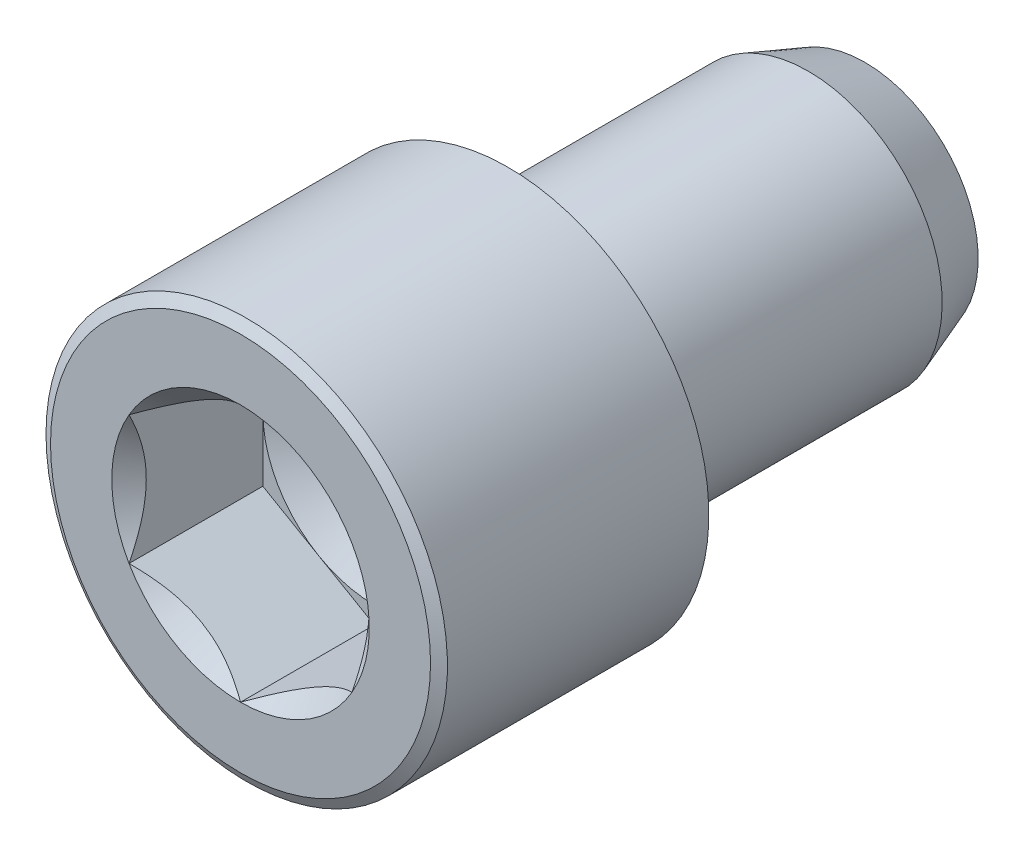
ISO-10303-21;
HEADER;
FILE_DESCRIPTION(('STEP AP214'),'2;1');
FILE_NAME('part.step','',(''),(''),'','','');
FILE_SCHEMA(('AUTOMOTIVE_DESIGN { 1 0 10303 214 1 1 1 1 }'));
ENDSEC;
DATA;
#1=APPLICATION_CONTEXT('core data for automotive mechanical design processes');
#2=APPLICATION_PROTOCOL_DEFINITION('international standard','automotive_design',2000,#1);
#3=PRODUCT_CONTEXT('',#1,'mechanical');
#4=PRODUCT('Part','Part','',(#3));
#5=PRODUCT_RELATED_PRODUCT_CATEGORY('part','',(#4));
#6=PRODUCT_DEFINITION_FORMATION('','',#4);
#7=PRODUCT_DEFINITION_CONTEXT('part definition',#1,'design');
#8=PRODUCT_DEFINITION('design','',#6,#7);
#9=PRODUCT_DEFINITION_SHAPE('','',#8);
#10=(LENGTH_UNIT() NAMED_UNIT(*) SI_UNIT(.MILLI.,.METRE.));
#11=(NAMED_UNIT(*) PLANE_ANGLE_UNIT() SI_UNIT($,.RADIAN.));
#12=(NAMED_UNIT(*) SI_UNIT($,.STERADIAN.) SOLID_ANGLE_UNIT());
#13=UNCERTAINTY_MEASURE_WITH_UNIT(LENGTH_MEASURE(1.E-05),#10,'distance_accuracy_value','');
#14=(GEOMETRIC_REPRESENTATION_CONTEXT(3) GLOBAL_UNCERTAINTY_ASSIGNED_CONTEXT((#13)) GLOBAL_UNIT_ASSIGNED_CONTEXT((#10,
#11,#12)) REPRESENTATION_CONTEXT('',''));
#15=CARTESIAN_POINT('',(0.,0.,0.));
#16=DIRECTION('',(0.,0.,1.));
#17=DIRECTION('',(1.,0.,0.));
#18=AXIS2_PLACEMENT_3D('',#15,#16,#17);
#19=CARTESIAN_POINT('',(3.96875,-6.87407664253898,4.7625));
#20=DIRECTION('',(0.,0.,1.));
#21=DIRECTION('',(1.,0.,0.));
#22=AXIS2_PLACEMENT_3D('',#19,#20,#21);
#23=PLANE('',#22);
#24=CARTESIAN_POINT('',(0.,0.,4.7625));
#25=DIRECTION('',(0.,0.,1.));
#26=DIRECTION('',(1.,0.,0.));
#27=AXIS2_PLACEMENT_3D('',#24,#25,#26);
#28=CIRCLE('',#27,3.96875);
#29=CARTESIAN_POINT('',(3.96875,0.,4.7625));
#30=VERTEX_POINT('',#29);
#31=CARTESIAN_POINT('',(1.984375,3.43703832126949,4.7625));
#32=VERTEX_POINT('',#31);
#33=EDGE_CURVE('E54',#30,#32,#28,.T.);
#34=ORIENTED_EDGE('',*,*,#33,.F.);
#35=DIRECTION('',(0.,1.,0.));
#36=VECTOR('',#35,1.);
#37=CARTESIAN_POINT('',(3.96875,-2.29135888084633,4.7625));
#38=LINE('',#37,#36);
#39=CARTESIAN_POINT('',(3.96875,2.29135888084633,4.7625));
#40=VERTEX_POINT('',#39);
#41=EDGE_CURVE('E124',#30,#40,#38,.T.);
#42=ORIENTED_EDGE('',*,*,#41,.T.);
#43=DIRECTION('',(-0.866025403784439,0.5,0.));
#44=VECTOR('',#43,1.);
#45=CARTESIAN_POINT('',(3.96875,2.29135888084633,4.7625));
#46=LINE('',#45,#44);
#47=EDGE_CURVE('E127',#40,#32,#46,.T.);
#48=ORIENTED_EDGE('',*,*,#47,.T.);
#49=EDGE_LOOP('',(#34,#42,#48));
#50=FACE_BOUND('',#49,.T.);
#51=ADVANCED_FACE('F37',(#50),#23,.T.);
#52=CARTESIAN_POINT('',(-1.984375,3.43703832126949,4.7625));
#53=VERTEX_POINT('',#52);
#54=EDGE_CURVE('E11',#32,#53,#28,.T.);
#55=ORIENTED_EDGE('',*,*,#54,.F.);
#56=CARTESIAN_POINT('',(0.,4.58271776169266,4.7625));
#57=VERTEX_POINT('',#56);
#58=EDGE_CURVE('E141',#32,#57,#46,.T.);
#59=ORIENTED_EDGE('',*,*,#58,.T.);
#60=DIRECTION('',(-0.866025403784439,-0.5,0.));
#61=VECTOR('',#60,1.);
#62=CARTESIAN_POINT('',(0.,4.58271776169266,4.7625));
#63=LINE('',#62,#61);
#64=EDGE_CURVE('E147',#57,#53,#63,.T.);
#65=ORIENTED_EDGE('',*,*,#64,.T.);
#66=EDGE_LOOP('',(#55,#59,#65));
#67=FACE_BOUND('',#66,.T.);
#68=ADVANCED_FACE('F305',(#67),#23,.T.);
#69=CARTESIAN_POINT('',(-3.96875,0.,4.7625));
#70=VERTEX_POINT('',#69);
#71=EDGE_CURVE('E52',#53,#70,#28,.T.);
#72=ORIENTED_EDGE('',*,*,#71,.F.);
#73=CARTESIAN_POINT('',(-3.96875,2.29135888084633,4.7625));
#74=VERTEX_POINT('',#73);
#75=EDGE_CURVE('E146',#53,#74,#63,.T.);
#76=ORIENTED_EDGE('',*,*,#75,.T.);
#77=DIRECTION('',(0.,-1.,0.));
#78=VECTOR('',#77,1.);
#79=CARTESIAN_POINT('',(-3.96875,2.29135888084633,4.7625));
#80=LINE('',#79,#78);
#81=EDGE_CURVE('E151',#74,#70,#80,.T.);
#82=ORIENTED_EDGE('',*,*,#81,.T.);
#83=EDGE_LOOP('',(#72,#76,#82));
#84=FACE_BOUND('',#83,.T.);
#85=ADVANCED_FACE('F309',(#84),#23,.T.);
#86=CARTESIAN_POINT('',(-1.984375,-3.43703832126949,4.7625));
#87=VERTEX_POINT('',#86);
#88=EDGE_CURVE('E322',#70,#87,#28,.T.);
#89=ORIENTED_EDGE('',*,*,#88,.F.);
#90=CARTESIAN_POINT('',(-3.96875,-2.29135888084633,4.7625));
#91=VERTEX_POINT('',#90);
#92=EDGE_CURVE('E150',#70,#91,#80,.T.);
#93=ORIENTED_EDGE('',*,*,#92,.T.);
#94=DIRECTION('',(0.866025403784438,-0.5,0.));
#95=VECTOR('',#94,1.);
#96=CARTESIAN_POINT('',(-3.96875,-2.29135888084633,4.7625));
#97=LINE('',#96,#95);
#98=EDGE_CURVE('E244',#91,#87,#97,.T.);
#99=ORIENTED_EDGE('',*,*,#98,.T.);
#100=EDGE_LOOP('',(#89,#93,#99));
#101=FACE_BOUND('',#100,.T.);
#102=ADVANCED_FACE('F314',(#101),#23,.T.);
#103=CARTESIAN_POINT('',(1.984375,-3.43703832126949,4.7625));
#104=VERTEX_POINT('',#103);
#105=EDGE_CURVE('E61',#87,#104,#28,.T.);
#106=ORIENTED_EDGE('',*,*,#105,.F.);
#107=CARTESIAN_POINT('',(0.,-4.58271776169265,4.7625));
#108=VERTEX_POINT('',#107);
#109=EDGE_CURVE('E228',#87,#108,#97,.T.);
#110=ORIENTED_EDGE('',*,*,#109,.T.);
#111=DIRECTION('',(0.866025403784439,0.5,0.));
#112=VECTOR('',#111,1.);
#113=CARTESIAN_POINT('',(0.,-4.58271776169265,4.7625));
#114=LINE('',#113,#112);
#115=EDGE_CURVE('E136',#108,#104,#114,.T.);
#116=ORIENTED_EDGE('',*,*,#115,.T.);
#117=EDGE_LOOP('',(#106,#110,#116));
#118=FACE_BOUND('',#117,.T.);
#119=ADVANCED_FACE('F303',(#118),#23,.T.);
#120=CARTESIAN_POINT('',(0.,0.,0.));
#121=DIRECTION('',(0.,0.,-1.));
#122=DIRECTION('',(0.,1.,0.));
#123=AXIS2_PLACEMENT_3D('',#120,#121,#122);
#124=CYLINDRICAL_SURFACE('',#123,4.7625);
#125=CARTESIAN_POINT('',(0.,0.,-10.6850324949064));
#126=DIRECTION('',(0.,0.,-1.));
#127=DIRECTION('',(0.,1.,0.));
#128=AXIS2_PLACEMENT_3D('',#125,#126,#127);
#129=CIRCLE('',#128,4.7625);
#130=CARTESIAN_POINT('',(0.,4.7625,-10.6850324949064));
#131=VERTEX_POINT('',#130);
#132=EDGE_CURVE('E178',#131,#131,#129,.T.);
#133=ORIENTED_EDGE('',*,*,#132,.F.);
#134=EDGE_LOOP('',(#133));
#135=FACE_BOUND('',#134,.T.);
#136=CARTESIAN_POINT('',(0.,0.,0.));
#137=DIRECTION('',(0.,0.,1.));
#138=DIRECTION('',(1.,0.,0.));
#139=AXIS2_PLACEMENT_3D('',#136,#137,#138);
#140=CIRCLE('',#139,4.7625);
#141=CARTESIAN_POINT('',(4.7625,0.,0.));
#142=VERTEX_POINT('',#141);
#143=EDGE_CURVE('E172',#142,#142,#140,.F.);
#144=ORIENTED_EDGE('',*,*,#143,.T.);
#145=EDGE_LOOP('',(#144));
#146=FACE_BOUND('',#145,.T.);
#147=ADVANCED_FACE('F326',(#135,#146),#124,.T.);
#148=CARTESIAN_POINT('',(0.,0.,-10.6850324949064));
#149=DIRECTION('',(0.,0.,1.));
#150=DIRECTION('',(0.,-1.,0.));
#151=AXIS2_PLACEMENT_3D('',#148,#149,#150);
#152=CONICAL_SURFACE('',#151,4.7625,0.349065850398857);
#153=CARTESIAN_POINT('',(0.,0.,-12.7));
#154=DIRECTION('',(0.,0.,-1.));
#155=DIRECTION('',(0.,1.,0.));
#156=AXIS2_PLACEMENT_3D('',#153,#154,#155);
#157=CIRCLE('',#156,4.02911180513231);
#158=CARTESIAN_POINT('',(0.,4.02911180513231,-12.7));
#159=VERTEX_POINT('',#158);
#160=EDGE_CURVE('E175',#159,#159,#157,.T.);
#161=ORIENTED_EDGE('',*,*,#160,.F.);
#162=EDGE_LOOP('',(#161));
#163=FACE_BOUND('',#162,.T.);
#164=ORIENTED_EDGE('',*,*,#132,.T.);
#165=EDGE_LOOP('',(#164));
#166=FACE_BOUND('',#165,.T.);
#167=ADVANCED_FACE('F331',(#163,#166),#152,.T.);
#168=CARTESIAN_POINT('',(0.,0.,-12.7));
#169=DIRECTION('',(0.,0.,-1.));
#170=DIRECTION('',(0.,1.,0.));
#171=AXIS2_PLACEMENT_3D('',#168,#169,#170);
#172=PLANE('',#171);
#173=ORIENTED_EDGE('',*,*,#160,.T.);
#174=EDGE_LOOP('',(#173));
#175=FACE_BOUND('',#174,.T.);
#176=ADVANCED_FACE('F422',(#175),#172,.T.);
#177=CARTESIAN_POINT('',(0.,0.,9.525));
#178=DIRECTION('',(0.,0.,-1.));
#179=DIRECTION('',(-1.,0.,0.));
#180=AXIS2_PLACEMENT_3D('',#177,#178,#179);
#181=CYLINDRICAL_SURFACE('',#180,7.14375);
#182=CARTESIAN_POINT('',(0.,0.,9.30502954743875));
#183=DIRECTION('',(0.,0.,1.));
#184=DIRECTION('',(1.,0.,0.));
#185=AXIS2_PLACEMENT_3D('',#182,#183,#184);
#186=CIRCLE('',#185,7.14375);
#187=CARTESIAN_POINT('',(-7.14375,0.,9.30502954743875));
#188=VERTEX_POINT('',#187);
#189=EDGE_CURVE('E183',#188,#188,#186,.F.);
#190=CARTESIAN_POINT('',(0.,0.,0.));
#191=DIRECTION('',(0.,0.,1.));
#192=DIRECTION('',(1.,0.,0.));
#193=AXIS2_PLACEMENT_3D('',#190,#191,#192);
#194=CIRCLE('',#193,7.14375);
#195=CARTESIAN_POINT('',(-7.14375,0.,0.));
#196=VERTEX_POINT('',#195);
#197=EDGE_CURVE('E158',#196,#196,#194,.T.);
#198=CARTESIAN_POINT('',(-7.14375,0.,9.30502954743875));
#199=CARTESIAN_POINT('',(-7.14375,0.,9.2081021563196));
#200=CARTESIAN_POINT('',(-7.14375,0.,9.11117476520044));
#201=CARTESIAN_POINT('',(-7.14375,0.,8.91731998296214));
#202=CARTESIAN_POINT('',(-7.14375,0.,8.82039259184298));
#203=CARTESIAN_POINT('',(-7.14375,0.,8.62653780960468));
#204=CARTESIAN_POINT('',(-7.14375,0.,8.52961041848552));
#205=CARTESIAN_POINT('',(-7.14375,0.,8.33575563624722));
#206=CARTESIAN_POINT('',(-7.14375,0.,8.23882824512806));
#207=CARTESIAN_POINT('',(-7.14375,0.,8.04497346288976));
#208=CARTESIAN_POINT('',(-7.14375,0.,7.9480460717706));
#209=CARTESIAN_POINT('',(-7.14375,0.,7.75419128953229));
#210=CARTESIAN_POINT('',(-7.14375,0.,7.65726389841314));
#211=CARTESIAN_POINT('',(-7.14375,0.,7.46340911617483));
#212=CARTESIAN_POINT('',(-7.14375,0.,7.36648172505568));
#213=CARTESIAN_POINT('',(-7.14375,0.,7.17262694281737));
#214=CARTESIAN_POINT('',(-7.14375,0.,7.07569955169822));
#215=CARTESIAN_POINT('',(-7.14375,0.,6.88184476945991));
#216=CARTESIAN_POINT('',(-7.14375,0.,6.78491737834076));
#217=CARTESIAN_POINT('',(-7.14375,0.,6.59106259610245));
#218=CARTESIAN_POINT('',(-7.14375,0.,6.4941352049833));
#219=CARTESIAN_POINT('',(-7.14375,0.,6.30028042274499));
#220=CARTESIAN_POINT('',(-7.14375,0.,6.20335303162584));
#221=CARTESIAN_POINT('',(-7.14375,0.,6.00949824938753));
#222=CARTESIAN_POINT('',(-7.14375,0.,5.91257085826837));
#223=CARTESIAN_POINT('',(-7.14375,0.,5.71871607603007));
#224=CARTESIAN_POINT('',(-7.14375,0.,5.62178868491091));
#225=CARTESIAN_POINT('',(-7.14375,0.,5.42793390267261));
#226=CARTESIAN_POINT('',(-7.14375,0.,5.33100651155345));
#227=CARTESIAN_POINT('',(-7.14375,0.,5.13715172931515));
#228=CARTESIAN_POINT('',(-7.14375,0.,5.04022433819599));
#229=CARTESIAN_POINT('',(-7.14375,0.,4.84636955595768));
#230=CARTESIAN_POINT('',(-7.14375,0.,4.74944216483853));
#231=CARTESIAN_POINT('',(-7.14375,0.,4.55558738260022));
#232=CARTESIAN_POINT('',(-7.14375,0.,4.45865999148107));
#233=CARTESIAN_POINT('',(-7.14375,0.,4.26480520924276));
#234=CARTESIAN_POINT('',(-7.14375,0.,4.16787781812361));
#235=CARTESIAN_POINT('',(-7.14375,0.,3.9740230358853));
#236=CARTESIAN_POINT('',(-7.14375,0.,3.87709564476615));
#237=CARTESIAN_POINT('',(-7.14375,0.,3.68324086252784));
#238=CARTESIAN_POINT('',(-7.14375,0.,3.58631347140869));
#239=CARTESIAN_POINT('',(-7.14375,0.,3.39245868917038));
#240=CARTESIAN_POINT('',(-7.14375,0.,3.29553129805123));
#241=CARTESIAN_POINT('',(-7.14375,0.,3.10167651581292));
#242=CARTESIAN_POINT('',(-7.14375,0.,3.00474912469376));
#243=CARTESIAN_POINT('',(-7.14375,0.,2.81089434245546));
#244=CARTESIAN_POINT('',(-7.14375,0.,2.7139669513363));
#245=CARTESIAN_POINT('',(-7.14375,0.,2.520112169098));
#246=CARTESIAN_POINT('',(-7.14375,0.,2.42318477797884));
#247=CARTESIAN_POINT('',(-7.14375,0.,2.22932999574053));
#248=CARTESIAN_POINT('',(-7.14375,0.,2.13240260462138));
#249=CARTESIAN_POINT('',(-7.14375,0.,1.93854782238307));
#250=CARTESIAN_POINT('',(-7.14375,0.,1.84162043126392));
#251=CARTESIAN_POINT('',(-7.14375,0.,1.64776564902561));
#252=CARTESIAN_POINT('',(-7.14375,0.,1.55083825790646));
#253=CARTESIAN_POINT('',(-7.14375,0.,1.35698347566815));
#254=CARTESIAN_POINT('',(-7.14375,0.,1.260056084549));
#255=CARTESIAN_POINT('',(-7.14375,0.,1.06620130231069));
#256=CARTESIAN_POINT('',(-7.14375,0.,0.969273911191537));
#257=CARTESIAN_POINT('',(-7.14375,0.,0.77541912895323));
#258=CARTESIAN_POINT('',(-7.14375,0.,0.678491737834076));
#259=CARTESIAN_POINT('',(-7.14375,0.,0.484636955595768));
#260=CARTESIAN_POINT('',(-7.14375,0.,0.387709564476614));
#261=CARTESIAN_POINT('',(-7.14375,0.,0.193854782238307));
#262=CARTESIAN_POINT('',(-7.14375,0.,0.0969273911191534));
#263=CARTESIAN_POINT('',(-7.14375,0.,0.));
#264=B_SPLINE_CURVE_WITH_KNOTS('',3,(#198,#199,#200,#201,#202,#203,#204,#205,#206,#207,#208,
#209,#210,#211,#212,#213,#214,#215,#216,#217,#218,#219,#220,#221,#222,#223,#224,#225,#226,#227,
#228,#229,#230,#231,#232,#233,#234,#235,#236,#237,#238,#239,#240,#241,#242,#243,#244,#245,#246,
#247,#248,#249,#250,#251,#252,#253,#254,#255,#256,#257,#258,#259,#260,#261,#262,#263),
.UNSPECIFIED.,.F.,.F.,(4,2,2,2,2,2,2,2,2,2,2,2,2,2,2,2,2,2,2,2,2,2,2,2,2,2,2,2,2,2,2,2,4),(0.,
0.29078217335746,0.58156434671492,0.872346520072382,1.16312869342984,1.4539108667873,
1.74469304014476,2.03547521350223,2.32625738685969,2.61703956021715,2.90782173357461,
3.19860390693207,3.48938608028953,3.78016825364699,4.07095042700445,4.36173260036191,
4.65251477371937,4.94329694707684,5.2340791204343,5.52486129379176,5.81564346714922,
6.10642564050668,6.39720781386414,6.6879899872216,6.97877216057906,7.26955433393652,
7.56033650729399,7.85111868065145,8.14190085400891,8.43268302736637,8.72346520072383,
9.01424737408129,9.30502954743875),.UNSPECIFIED.);
#265=EDGE_CURVE('BSEAM404',#188,#196,#264,.T.);
#266=ORIENTED_EDGE('',*,*,#189,.T.);
#267=ORIENTED_EDGE('',*,*,#197,.T.);
#268=ORIENTED_EDGE('',*,*,#265,.T.);
#269=ORIENTED_EDGE('',*,*,#265,.F.);
#270=EDGE_LOOP('',(#266,#268,#267,#269));
#271=FACE_BOUND('',#270,.T.);
#272=ADVANCED_FACE('F404',(#271),#181,.T.);
#273=CARTESIAN_POINT('',(0.,0.,9.525));
#274=DIRECTION('',(0.,0.,1.));
#275=DIRECTION('',(1.,0.,0.));
#276=AXIS2_PLACEMENT_3D('',#273,#274,#275);
#277=PLANE('',#276);
#278=CARTESIAN_POINT('',(0.,0.,9.525));
#279=DIRECTION('',(0.,0.,1.));
#280=DIRECTION('',(1.,0.,0.));
#281=AXIS2_PLACEMENT_3D('',#278,#279,#280);
#282=CIRCLE('',#281,4.58271776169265);
#283=CARTESIAN_POINT('',(3.96875,2.29135888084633,9.525));
#284=VERTEX_POINT('',#283);
#285=CARTESIAN_POINT('',(0.,4.58271776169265,9.525));
#286=VERTEX_POINT('',#285);
#287=EDGE_CURVE('E211',#284,#286,#282,.T.);
#288=ORIENTED_EDGE('',*,*,#287,.F.);
#289=CARTESIAN_POINT('',(3.96875,-2.29135888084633,9.525));
#290=VERTEX_POINT('',#289);
#291=EDGE_CURVE('E204',#290,#284,#282,.T.);
#292=ORIENTED_EDGE('',*,*,#291,.F.);
#293=CARTESIAN_POINT('',(0.,-4.58271776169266,9.525));
#294=VERTEX_POINT('',#293);
#295=EDGE_CURVE('E197',#294,#290,#282,.T.);
#296=ORIENTED_EDGE('',*,*,#295,.F.);
#297=CARTESIAN_POINT('',(-3.96875,-2.29135888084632,9.525));
#298=VERTEX_POINT('',#297);
#299=EDGE_CURVE('E203',#298,#294,#282,.T.);
#300=ORIENTED_EDGE('',*,*,#299,.F.);
#301=CARTESIAN_POINT('',(-3.96875,2.29135888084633,9.525));
#302=VERTEX_POINT('',#301);
#303=EDGE_CURVE('E68',#302,#298,#282,.T.);
#304=ORIENTED_EDGE('',*,*,#303,.F.);
#305=EDGE_CURVE('E219',#286,#302,#282,.T.);
#306=ORIENTED_EDGE('',*,*,#305,.F.);
#307=EDGE_LOOP('',(#288,#292,#296,#300,#304,#306));
#308=FACE_BOUND('',#307,.T.);
#309=CARTESIAN_POINT('',(0.,0.,9.525));
#310=DIRECTION('',(0.,0.,1.));
#311=DIRECTION('',(1.,0.,0.));
#312=AXIS2_PLACEMENT_3D('',#309,#310,#311);
#313=CIRCLE('',#312,6.76275);
#314=CARTESIAN_POINT('',(6.76275,0.,9.525));
#315=VERTEX_POINT('',#314);
#316=EDGE_CURVE('E181',#315,#315,#313,.T.);
#317=ORIENTED_EDGE('',*,*,#316,.T.);
#318=EDGE_LOOP('',(#317));
#319=FACE_BOUND('',#318,.T.);
#320=ADVANCED_FACE('F214',(#308,#319),#277,.T.);
#321=CARTESIAN_POINT('',(0.,0.,0.));
#322=DIRECTION('',(0.,0.,1.));
#323=DIRECTION('',(1.,0.,0.));
#324=AXIS2_PLACEMENT_3D('',#321,#322,#323);
#325=PLANE('',#324);
#326=ORIENTED_EDGE('',*,*,#143,.F.);
#327=EDGE_LOOP('',(#326));
#328=FACE_BOUND('',#327,.T.);
#329=ORIENTED_EDGE('',*,*,#197,.F.);
#330=EDGE_LOOP('',(#329));
#331=FACE_BOUND('',#330,.T.);
#332=ADVANCED_FACE('F403',(#328,#331),#325,.F.);
#333=CARTESIAN_POINT('',(0.,0.,9.525));
#334=DIRECTION('',(0.,0.,-1.));
#335=DIRECTION('',(-1.,0.,0.));
#336=AXIS2_PLACEMENT_3D('',#333,#334,#335);
#337=CONICAL_SURFACE('',#336,6.76275,1.0471975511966);
#338=ORIENTED_EDGE('',*,*,#189,.F.);
#339=EDGE_LOOP('',(#338));
#340=FACE_BOUND('',#339,.T.);
#341=ORIENTED_EDGE('',*,*,#316,.F.);
#342=EDGE_LOOP('',(#341));
#343=FACE_BOUND('',#342,.T.);
#344=ADVANCED_FACE('F39',(#340,#343),#337,.T.);
#345=CARTESIAN_POINT('',(0.,0.,9.525));
#346=DIRECTION('',(0.,0.,1.));
#347=DIRECTION('',(1.,0.,0.));
#348=AXIS2_PLACEMENT_3D('',#345,#346,#347);
#349=CONICAL_SURFACE('',#348,4.58271776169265,0.78539816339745);
#350=ORIENTED_EDGE('',*,*,#295,.T.);
#351=CARTESIAN_POINT('',(-0.000200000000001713,-4.58283323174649,9.52511547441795));
#352=CARTESIAN_POINT('',(0.0680436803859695,-4.54343272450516,9.48571901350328));
#353=CARTESIAN_POINT('',(0.136809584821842,-4.50373071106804,9.44753121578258));
#354=CARTESIAN_POINT('',(0.275493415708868,-4.42366156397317,9.3739413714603));
#355=CARTESIAN_POINT('',(0.345411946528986,-4.38329408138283,9.33854084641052));
#356=CARTESIAN_POINT('',(0.557707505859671,-4.2607251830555,9.23677090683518));
#357=CARTESIAN_POINT('',(0.701888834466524,-4.17748205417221,9.17526734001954));
#358=CARTESIAN_POINT('',(0.992585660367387,-4.00964816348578,9.06993929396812));
#359=CARTESIAN_POINT('',(1.13902772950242,-3.92509979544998,9.02584957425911));
#360=CARTESIAN_POINT('',(1.43514553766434,-3.75413609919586,8.95791431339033));
#361=CARTESIAN_POINT('',(1.58481220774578,-3.66772600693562,8.9340180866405));
#362=CARTESIAN_POINT('',(1.84275672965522,-3.51880166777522,8.9124580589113));
#363=CARTESIAN_POINT('',(1.95070224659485,-3.45647929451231,8.90926720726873));
#364=CARTESIAN_POINT('',(2.16641807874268,-3.3319357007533,8.91464597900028));
#365=CARTESIAN_POINT('',(2.27418831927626,-3.2697145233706,8.92321972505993));
#366=CARTESIAN_POINT('',(2.48870765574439,-3.14586172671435,8.95163865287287));
#367=CARTESIAN_POINT('',(2.59545547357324,-3.08423084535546,8.9714964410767));
#368=CARTESIAN_POINT('',(2.80711777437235,-2.96202755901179,9.02139945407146));
#369=CARTESIAN_POINT('',(2.91203239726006,-2.90145507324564,9.05144389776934));
#370=CARTESIAN_POINT('',(3.0982812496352,-2.7939242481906,9.11325729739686));
#371=CARTESIAN_POINT('',(3.18002783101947,-2.74672783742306,9.1434010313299));
#372=CARTESIAN_POINT('',(3.34205349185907,-2.65318227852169,9.2085463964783));
#373=CARTESIAN_POINT('',(3.42233252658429,-2.6068331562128,9.24354817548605));
#374=CARTESIAN_POINT('',(3.58117016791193,-2.51512820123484,9.31762497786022));
#375=CARTESIAN_POINT('',(3.65973329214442,-2.46976976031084,9.35668719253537));
#376=CARTESIAN_POINT('',(3.81540464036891,-2.37989286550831,9.43837192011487));
#377=CARTESIAN_POINT('',(3.89251372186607,-2.33537391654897,9.48099224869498));
#378=CARTESIAN_POINT('',(3.96895,-2.29124341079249,9.52511547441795));
#379=B_SPLINE_CURVE_WITH_KNOTS('',3,(#351,#352,#353,#354,#355,#356,#357,#358,#359,#360,#361,
#362,#363,#364,#365,#366,#367,#368,#369,#370,#371,#372,#373,#374,#375,#376,#377,#378),
.UNSPECIFIED.,.F.,.F.,(4,2,2,2,2,2,2,2,2,2,2,2,2,4),(0.,0.264281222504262,0.528705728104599,
1.06040984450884,1.58367029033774,2.10561342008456,2.47914251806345,2.85280254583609,
3.22688084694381,3.60093047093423,3.89805841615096,4.19519540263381,4.49142198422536,
4.78746803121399),.UNSPECIFIED.);
#380=EDGE_CURVE('E41',#294,#290,#379,.T.);
#381=ORIENTED_EDGE('',*,*,#380,.F.);
#382=EDGE_LOOP('',(#350,#381));
#383=FACE_BOUND('',#382,.T.);
#384=ADVANCED_FACE('F199',(#383),#349,.F.);
#385=ORIENTED_EDGE('',*,*,#291,.T.);
#386=CARTESIAN_POINT('',(3.96875,-4.56990484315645,10.9949681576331));
#387=CARTESIAN_POINT('',(3.96875,-4.45863268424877,10.9109744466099));
#388=CARTESIAN_POINT('',(3.96875,-4.34673751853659,10.8277926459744));
#389=CARTESIAN_POINT('',(3.96875,-4.12145541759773,10.6634163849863));
#390=CARTESIAN_POINT('',(3.96875,-4.00806811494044,10.5822224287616));
#391=CARTESIAN_POINT('',(3.96875,-3.77872655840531,10.4216080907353));
#392=CARTESIAN_POINT('',(3.96875,-3.66275922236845,10.3422063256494));
#393=CARTESIAN_POINT('',(3.96875,-3.42885613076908,10.1863665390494));
#394=CARTESIAN_POINT('',(3.96875,-3.31092051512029,10.1099283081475));
#395=CARTESIAN_POINT('',(3.96875,-3.06596138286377,9.95640911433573));
#396=CARTESIAN_POINT('',(3.96875,-2.9388037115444,9.87954112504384));
#397=CARTESIAN_POINT('',(3.96875,-2.68152025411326,9.73086253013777));
#398=CARTESIAN_POINT('',(3.96875,-2.55139400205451,9.65905272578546));
#399=CARTESIAN_POINT('',(3.96875,-2.288185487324,9.52203990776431));
#400=CARTESIAN_POINT('',(3.96875,-2.15511341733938,9.45681746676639));
#401=CARTESIAN_POINT('',(3.96875,-1.88534004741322,9.33443946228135));
#402=CARTESIAN_POINT('',(3.96875,-1.74864042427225,9.27728024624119));
#403=CARTESIAN_POINT('',(3.96875,-1.48255876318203,9.17725771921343));
#404=CARTESIAN_POINT('',(3.96875,-1.35347311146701,9.13361413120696));
#405=CARTESIAN_POINT('',(3.96875,-1.09219394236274,9.05668291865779));
#406=CARTESIAN_POINT('',(3.96875,-0.960000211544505,9.02339600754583));
#407=CARTESIAN_POINT('',(3.96875,-0.695492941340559,8.96947024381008));
#408=CARTESIAN_POINT('',(3.96875,-0.563224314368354,8.94861468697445));
#409=CARTESIAN_POINT('',(3.96875,-0.297273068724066,8.91995642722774));
#410=CARTESIAN_POINT('',(3.96875,-0.163590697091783,8.91215148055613));
#411=CARTESIAN_POINT('',(3.96875,0.0990312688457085,8.910174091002));
#412=CARTESIAN_POINT('',(3.96875,0.227967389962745,8.91551843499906));
#413=CARTESIAN_POINT('',(3.96875,0.484735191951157,8.93847834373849));
#414=CARTESIAN_POINT('',(3.96875,0.61256676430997,8.95609510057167));
#415=CARTESIAN_POINT('',(3.96875,0.868361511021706,9.00293836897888));
#416=CARTESIAN_POINT('',(3.96875,0.996287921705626,9.03236244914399));
#417=CARTESIAN_POINT('',(3.96875,1.24935336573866,9.10125112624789));
#418=CARTESIAN_POINT('',(3.96875,1.37449263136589,9.14071488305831));
#419=CARTESIAN_POINT('',(3.96875,1.63331643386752,9.23211814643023));
#420=CARTESIAN_POINT('',(3.96875,1.76670819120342,9.28487836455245));
#421=CARTESIAN_POINT('',(3.96875,2.03002683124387,9.39849870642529));
#422=CARTESIAN_POINT('',(3.96875,2.15995206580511,9.4593626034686));
#423=CARTESIAN_POINT('',(3.96875,2.4169726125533,9.58774222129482));
#424=CARTESIAN_POINT('',(3.96875,2.54405740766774,9.65527882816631));
#425=CARTESIAN_POINT('',(3.96875,2.7953024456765,9.79551112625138));
#426=CARTESIAN_POINT('',(3.96875,2.91946314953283,9.86820599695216));
#427=CARTESIAN_POINT('',(3.96875,3.15913302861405,10.0140188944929));
#428=CARTESIAN_POINT('',(3.96875,3.27476522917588,10.0869357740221));
#429=CARTESIAN_POINT('',(3.96875,3.50404450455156,10.2358358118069));
#430=CARTESIAN_POINT('',(3.96875,3.61769142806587,10.3118192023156));
#431=CARTESIAN_POINT('',(3.96875,3.84233840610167,10.4656765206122));
#432=CARTESIAN_POINT('',(3.96875,3.95335246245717,10.543530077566));
#433=CARTESIAN_POINT('',(3.96875,4.17386344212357,10.7012960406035));
#434=CARTESIAN_POINT('',(3.96875,4.28336077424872,10.7812078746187));
#435=CARTESIAN_POINT('',(3.96875,4.39222298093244,10.8619612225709));
#436=B_SPLINE_CURVE_WITH_KNOTS('',3,(#386,#387,#388,#389,#390,#391,#392,#393,#394,#395,#396,
#397,#398,#399,#400,#401,#402,#403,#404,#405,#406,#407,#408,#409,#410,#411,#412,#413,#414,#415,
#416,#417,#418,#419,#420,#421,#422,#423,#424,#425,#426,#427,#428,#429,#430,#431,#432,#433,#434,
#435),.UNSPECIFIED.,.F.,.F.,(4,2,2,2,2,2,2,2,2,2,2,2,2,2,2,2,2,2,2,2,2,2,2,2,4),(0.,
0.418252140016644,0.836609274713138,1.25820795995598,1.67977680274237,2.12544086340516,
2.57117536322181,3.01555437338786,3.45973143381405,3.86816421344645,4.27662512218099,
4.6777400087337,5.07878592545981,5.46531568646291,5.85188299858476,6.24520796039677,
6.63850001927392,7.06850560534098,7.49871211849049,7.93031065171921,8.3618406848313,
8.77189246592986,9.18197536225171,9.58872710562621,9.99536699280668),.UNSPECIFIED.);
#437=EDGE_CURVE('E207',#290,#284,#436,.T.);
#438=ORIENTED_EDGE('',*,*,#437,.F.);
#439=EDGE_LOOP('',(#385,#438));
#440=FACE_BOUND('',#439,.T.);
#441=ADVANCED_FACE('F208',(#440),#349,.F.);
#442=ORIENTED_EDGE('',*,*,#287,.T.);
#443=CARTESIAN_POINT('',(3.96895,2.29124341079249,9.52511547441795));
#444=CARTESIAN_POINT('',(3.90070631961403,2.33064391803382,9.48571901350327));
#445=CARTESIAN_POINT('',(3.83194041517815,2.37034593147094,9.44753121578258));
#446=CARTESIAN_POINT('',(3.69325658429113,2.45041507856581,9.3739413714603));
#447=CARTESIAN_POINT('',(3.62333805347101,2.49078256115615,9.33854084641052));
#448=CARTESIAN_POINT('',(3.41104249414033,2.61335145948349,9.23677090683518));
#449=CARTESIAN_POINT('',(3.26686116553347,2.69659458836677,9.17526734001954));
#450=CARTESIAN_POINT('',(2.97616433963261,2.8644284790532,9.06993929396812));
#451=CARTESIAN_POINT('',(2.82972227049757,2.948976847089,9.02584957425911));
#452=CARTESIAN_POINT('',(2.53360446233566,3.11994054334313,8.95791431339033));
#453=CARTESIAN_POINT('',(2.38393779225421,3.20635063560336,8.9340180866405));
#454=CARTESIAN_POINT('',(2.12599327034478,3.35527497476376,8.9124580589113));
#455=CARTESIAN_POINT('',(2.01804775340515,3.41759734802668,8.90926720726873));
#456=CARTESIAN_POINT('',(1.80233192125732,3.54214094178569,8.91464597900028));
#457=CARTESIAN_POINT('',(1.69456168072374,3.60436211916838,8.92321972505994));
#458=CARTESIAN_POINT('',(1.4800423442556,3.72821491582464,8.95163865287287));
#459=CARTESIAN_POINT('',(1.37329452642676,3.78984579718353,8.9714964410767));
#460=CARTESIAN_POINT('',(1.16163222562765,3.91204908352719,9.02139945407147));
#461=CARTESIAN_POINT('',(1.05671760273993,3.97262156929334,9.05144389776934));
#462=CARTESIAN_POINT('',(0.870468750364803,4.08015239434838,9.11325729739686));
#463=CARTESIAN_POINT('',(0.788722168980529,4.12734880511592,9.1434010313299));
#464=CARTESIAN_POINT('',(0.626696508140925,4.22089436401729,9.2085463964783));
#465=CARTESIAN_POINT('',(0.546417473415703,4.26724348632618,9.24354817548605));
#466=CARTESIAN_POINT('',(0.387579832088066,4.35894844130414,9.31762497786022));
#467=CARTESIAN_POINT('',(0.309016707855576,4.40430688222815,9.35668719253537));
#468=CARTESIAN_POINT('',(0.153345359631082,4.49418377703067,9.43837192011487));
#469=CARTESIAN_POINT('',(0.0762362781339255,4.53870272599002,9.48099224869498));
#470=CARTESIAN_POINT('',(-0.000200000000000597,4.58283323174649,9.52511547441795));
#471=B_SPLINE_CURVE_WITH_KNOTS('',3,(#443,#444,#445,#446,#447,#448,#449,#450,#451,#452,#453,
#454,#455,#456,#457,#458,#459,#460,#461,#462,#463,#464,#465,#466,#467,#468,#469,#470),
.UNSPECIFIED.,.F.,.F.,(4,2,2,2,2,2,2,2,2,2,2,2,2,4),(0.,0.264281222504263,0.528705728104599,
1.06040984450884,1.58367029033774,2.10561342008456,2.47914251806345,2.85280254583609,
3.22688084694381,3.60093047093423,3.89805841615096,4.19519540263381,4.49142198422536,
4.78746803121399),.UNSPECIFIED.);
#472=EDGE_CURVE('E210',#284,#286,#471,.T.);
#473=ORIENTED_EDGE('',*,*,#472,.F.);
#474=EDGE_LOOP('',(#442,#473));
#475=FACE_BOUND('',#474,.T.);
#476=ADVANCED_FACE('F372',(#475),#349,.F.);
#477=ORIENTED_EDGE('',*,*,#305,.T.);
#478=CARTESIAN_POINT('',(0.000200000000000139,4.58283323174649,9.52511547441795));
#479=CARTESIAN_POINT('',(-0.0680436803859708,4.54343272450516,9.48571901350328));
#480=CARTESIAN_POINT('',(-0.136809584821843,4.50373071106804,9.44753121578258));
#481=CARTESIAN_POINT('',(-0.27549341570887,4.42366156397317,9.3739413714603));
#482=CARTESIAN_POINT('',(-0.345411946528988,4.38329408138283,9.33854084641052));
#483=CARTESIAN_POINT('',(-0.557707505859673,4.2607251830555,9.23677090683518));
#484=CARTESIAN_POINT('',(-0.701888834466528,4.17748205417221,9.17526734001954));
#485=CARTESIAN_POINT('',(-0.992585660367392,4.00964816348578,9.06993929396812));
#486=CARTESIAN_POINT('',(-1.13902772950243,3.92509979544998,9.02584957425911));
#487=CARTESIAN_POINT('',(-1.43514553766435,3.75413609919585,8.95791431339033));
#488=CARTESIAN_POINT('',(-1.58481220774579,3.66772600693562,8.9340180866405));
#489=CARTESIAN_POINT('',(-1.84275672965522,3.51880166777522,8.9124580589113));
#490=CARTESIAN_POINT('',(-1.95070224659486,3.45647929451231,8.90926720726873));
#491=CARTESIAN_POINT('',(-2.16641807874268,3.3319357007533,8.91464597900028));
#492=CARTESIAN_POINT('',(-2.27418831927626,3.2697145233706,8.92321972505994));
#493=CARTESIAN_POINT('',(-2.4887076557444,3.14586172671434,8.95163865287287));
#494=CARTESIAN_POINT('',(-2.59545547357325,3.08423084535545,8.9714964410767));
#495=CARTESIAN_POINT('',(-2.80711777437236,2.96202755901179,9.02139945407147));
#496=CARTESIAN_POINT('',(-2.91203239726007,2.90145507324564,9.05144389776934));
#497=CARTESIAN_POINT('',(-3.0982812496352,2.7939242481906,9.11325729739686));
#498=CARTESIAN_POINT('',(-3.18002783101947,2.74672783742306,9.1434010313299));
#499=CARTESIAN_POINT('',(-3.34205349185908,2.65318227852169,9.2085463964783));
#500=CARTESIAN_POINT('',(-3.4223325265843,2.6068331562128,9.24354817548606));
#501=CARTESIAN_POINT('',(-3.58117016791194,2.51512820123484,9.31762497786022));
#502=CARTESIAN_POINT('',(-3.65973329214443,2.46976976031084,9.35668719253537));
#503=CARTESIAN_POINT('',(-3.81540464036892,2.37989286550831,9.43837192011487));
#504=CARTESIAN_POINT('',(-3.89251372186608,2.33537391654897,9.48099224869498));
#505=CARTESIAN_POINT('',(-3.96895,2.29124341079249,9.52511547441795));
#506=B_SPLINE_CURVE_WITH_KNOTS('',3,(#478,#479,#480,#481,#482,#483,#484,#485,#486,#487,#488,
#489,#490,#491,#492,#493,#494,#495,#496,#497,#498,#499,#500,#501,#502,#503,#504,#505),
.UNSPECIFIED.,.F.,.F.,(4,2,2,2,2,2,2,2,2,2,2,2,2,4),(0.,0.264281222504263,0.5287057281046,
1.06040984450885,1.58367029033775,2.10561342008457,2.47914251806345,2.85280254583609,
3.22688084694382,3.60093047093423,3.89805841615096,4.19519540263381,4.49142198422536,
4.78746803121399),.UNSPECIFIED.);
#507=EDGE_CURVE('E239',#286,#302,#506,.T.);
#508=ORIENTED_EDGE('',*,*,#507,.F.);
#509=EDGE_LOOP('',(#477,#508));
#510=FACE_BOUND('',#509,.T.);
#511=ADVANCED_FACE('F364',(#510),#349,.F.);
#512=ORIENTED_EDGE('',*,*,#303,.T.);
#513=CARTESIAN_POINT('',(-3.96875,-4.56990484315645,10.9949681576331));
#514=CARTESIAN_POINT('',(-3.96875,-4.45863268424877,10.9109744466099));
#515=CARTESIAN_POINT('',(-3.96875,-4.34673751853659,10.8277926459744));
#516=CARTESIAN_POINT('',(-3.96875,-4.12145541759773,10.6634163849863));
#517=CARTESIAN_POINT('',(-3.96875,-4.00806811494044,10.5822224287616));
#518=CARTESIAN_POINT('',(-3.96875,-3.77872655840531,10.4216080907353));
#519=CARTESIAN_POINT('',(-3.96875,-3.66275922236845,10.3422063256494));
#520=CARTESIAN_POINT('',(-3.96875,-3.42885613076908,10.1863665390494));
#521=CARTESIAN_POINT('',(-3.96875,-3.31092051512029,10.1099283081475));
#522=CARTESIAN_POINT('',(-3.96875,-3.06596138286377,9.95640911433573));
#523=CARTESIAN_POINT('',(-3.96875,-2.9388037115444,9.87954112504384));
#524=CARTESIAN_POINT('',(-3.96875,-2.68152025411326,9.73086253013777));
#525=CARTESIAN_POINT('',(-3.96875,-2.55139400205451,9.65905272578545));
#526=CARTESIAN_POINT('',(-3.96875,-2.288185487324,9.52203990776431));
#527=CARTESIAN_POINT('',(-3.96875,-2.15511341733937,9.45681746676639));
#528=CARTESIAN_POINT('',(-3.96875,-1.88534004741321,9.33443946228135));
#529=CARTESIAN_POINT('',(-3.96875,-1.74864042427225,9.27728024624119));
#530=CARTESIAN_POINT('',(-3.96875,-1.48255876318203,9.17725771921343));
#531=CARTESIAN_POINT('',(-3.96875,-1.35347311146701,9.13361413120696));
#532=CARTESIAN_POINT('',(-3.96875,-1.09219394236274,9.05668291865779));
#533=CARTESIAN_POINT('',(-3.96875,-0.960000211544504,9.02339600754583));
#534=CARTESIAN_POINT('',(-3.96875,-0.695492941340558,8.96947024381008));
#535=CARTESIAN_POINT('',(-3.96875,-0.563224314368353,8.94861468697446));
#536=CARTESIAN_POINT('',(-3.96875,-0.297273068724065,8.91995642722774));
#537=CARTESIAN_POINT('',(-3.96875,-0.163590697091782,8.91215148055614));
#538=CARTESIAN_POINT('',(-3.96875,0.0990312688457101,8.910174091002));
#539=CARTESIAN_POINT('',(-3.96875,0.227967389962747,8.91551843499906));
#540=CARTESIAN_POINT('',(-3.96875,0.484735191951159,8.9384783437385));
#541=CARTESIAN_POINT('',(-3.96875,0.612566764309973,8.95609510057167));
#542=CARTESIAN_POINT('',(-3.96875,0.868361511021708,9.00293836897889));
#543=CARTESIAN_POINT('',(-3.96875,0.996287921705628,9.03236244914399));
#544=CARTESIAN_POINT('',(-3.96875,1.24935336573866,9.10125112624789));
#545=CARTESIAN_POINT('',(-3.96875,1.37449263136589,9.14071488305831));
#546=CARTESIAN_POINT('',(-3.96875,1.63331643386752,9.23211814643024));
#547=CARTESIAN_POINT('',(-3.96875,1.76670819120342,9.28487836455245));
#548=CARTESIAN_POINT('',(-3.96875,2.03002683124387,9.39849870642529));
#549=CARTESIAN_POINT('',(-3.96875,2.15995206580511,9.45936260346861));
#550=CARTESIAN_POINT('',(-3.96875,2.4169726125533,9.58774222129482));
#551=CARTESIAN_POINT('',(-3.96875,2.54405740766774,9.65527882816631));
#552=CARTESIAN_POINT('',(-3.96875,2.7953024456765,9.79551112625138));
#553=CARTESIAN_POINT('',(-3.96875,2.91946314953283,9.86820599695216));
#554=CARTESIAN_POINT('',(-3.96875,3.15913302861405,10.0140188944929));
#555=CARTESIAN_POINT('',(-3.96875,3.27476522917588,10.0869357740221));
#556=CARTESIAN_POINT('',(-3.96875,3.50404450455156,10.2358358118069));
#557=CARTESIAN_POINT('',(-3.96875,3.61769142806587,10.3118192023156));
#558=CARTESIAN_POINT('',(-3.96875,3.84233840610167,10.4656765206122));
#559=CARTESIAN_POINT('',(-3.96875,3.95335246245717,10.543530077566));
#560=CARTESIAN_POINT('',(-3.96875,4.17386344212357,10.7012960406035));
#561=CARTESIAN_POINT('',(-3.96875,4.28336077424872,10.7812078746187));
#562=CARTESIAN_POINT('',(-3.96875,4.39222298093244,10.8619612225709));
#563=B_SPLINE_CURVE_WITH_KNOTS('',3,(#513,#514,#515,#516,#517,#518,#519,#520,#521,#522,#523,
#524,#525,#526,#527,#528,#529,#530,#531,#532,#533,#534,#535,#536,#537,#538,#539,#540,#541,#542,
#543,#544,#545,#546,#547,#548,#549,#550,#551,#552,#553,#554,#555,#556,#557,#558,#559,#560,#561,
#562),.UNSPECIFIED.,.F.,.F.,(4,2,2,2,2,2,2,2,2,2,2,2,2,2,2,2,2,2,2,2,2,2,2,2,4),(0.,
0.418252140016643,0.836609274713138,1.25820795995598,1.67977680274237,2.12544086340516,
2.57117536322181,3.01555437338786,3.45973143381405,3.86816421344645,4.27662512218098,
4.67774000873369,5.0787859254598,5.46531568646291,5.85188299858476,6.24520796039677,
6.63850001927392,7.06850560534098,7.49871211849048,7.9303106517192,8.3618406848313,
8.77189246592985,9.1819753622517,9.5887271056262,9.99536699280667),.UNSPECIFIED.);
#564=EDGE_CURVE('E229',#302,#298,#563,.F.);
#565=ORIENTED_EDGE('',*,*,#564,.F.);
#566=EDGE_LOOP('',(#512,#565));
#567=FACE_BOUND('',#566,.T.);
#568=ADVANCED_FACE('F264',(#567),#349,.F.);
#569=ORIENTED_EDGE('',*,*,#299,.T.);
#570=CARTESIAN_POINT('',(-3.96895,-2.29124341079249,9.52511547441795));
#571=CARTESIAN_POINT('',(-3.90070631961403,-2.33064391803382,9.48571901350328));
#572=CARTESIAN_POINT('',(-3.83194041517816,-2.37034593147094,9.44753121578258));
#573=CARTESIAN_POINT('',(-3.69325658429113,-2.45041507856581,9.3739413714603));
#574=CARTESIAN_POINT('',(-3.62333805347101,-2.49078256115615,9.33854084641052));
#575=CARTESIAN_POINT('',(-3.41104249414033,-2.61335145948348,9.23677090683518));
#576=CARTESIAN_POINT('',(-3.26686116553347,-2.69659458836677,9.17526734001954));
#577=CARTESIAN_POINT('',(-2.97616433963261,-2.8644284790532,9.06993929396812));
#578=CARTESIAN_POINT('',(-2.82972227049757,-2.948976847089,9.02584957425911));
#579=CARTESIAN_POINT('',(-2.53360446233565,-3.11994054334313,8.95791431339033));
#580=CARTESIAN_POINT('',(-2.38393779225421,-3.20635063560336,8.9340180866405));
#581=CARTESIAN_POINT('',(-2.12599327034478,-3.35527497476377,8.9124580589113));
#582=CARTESIAN_POINT('',(-2.01804775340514,-3.41759734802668,8.90926720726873));
#583=CARTESIAN_POINT('',(-1.80233192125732,-3.54214094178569,8.91464597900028));
#584=CARTESIAN_POINT('',(-1.69456168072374,-3.60436211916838,8.92321972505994));
#585=CARTESIAN_POINT('',(-1.4800423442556,-3.72821491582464,8.95163865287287));
#586=CARTESIAN_POINT('',(-1.37329452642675,-3.78984579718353,8.9714964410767));
#587=CARTESIAN_POINT('',(-1.16163222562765,-3.91204908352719,9.02139945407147));
#588=CARTESIAN_POINT('',(-1.05671760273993,-3.97262156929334,9.05144389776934));
#589=CARTESIAN_POINT('',(-0.870468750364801,-4.08015239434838,9.11325729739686));
#590=CARTESIAN_POINT('',(-0.788722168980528,-4.12734880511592,9.1434010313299));
#591=CARTESIAN_POINT('',(-0.626696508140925,-4.22089436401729,9.2085463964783));
#592=CARTESIAN_POINT('',(-0.546417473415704,-4.26724348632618,9.24354817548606));
#593=CARTESIAN_POINT('',(-0.387579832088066,-4.35894844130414,9.31762497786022));
#594=CARTESIAN_POINT('',(-0.309016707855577,-4.40430688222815,9.35668719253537));
#595=CARTESIAN_POINT('',(-0.153345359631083,-4.49418377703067,9.43837192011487));
#596=CARTESIAN_POINT('',(-0.0762362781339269,-4.53870272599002,9.48099224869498));
#597=CARTESIAN_POINT('',(0.000199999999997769,-4.58283323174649,9.52511547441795));
#598=B_SPLINE_CURVE_WITH_KNOTS('',3,(#570,#571,#572,#573,#574,#575,#576,#577,#578,#579,#580,
#581,#582,#583,#584,#585,#586,#587,#588,#589,#590,#591,#592,#593,#594,#595,#596,#597),
.UNSPECIFIED.,.F.,.F.,(4,2,2,2,2,2,2,2,2,2,2,2,2,4),(0.,0.264281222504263,0.5287057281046,
1.06040984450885,1.58367029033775,2.10561342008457,2.47914251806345,2.85280254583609,
3.22688084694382,3.60093047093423,3.89805841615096,4.19519540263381,4.49142198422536,
4.78746803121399),.UNSPECIFIED.);
#599=EDGE_CURVE('E225',#298,#294,#598,.T.);
#600=ORIENTED_EDGE('',*,*,#599,.F.);
#601=EDGE_LOOP('',(#569,#600));
#602=FACE_BOUND('',#601,.T.);
#603=ADVANCED_FACE('F224',(#602),#349,.F.);
#604=EDGE_CURVE('E114',#104,#30,#28,.T.);
#605=ORIENTED_EDGE('',*,*,#604,.F.);
#606=CARTESIAN_POINT('',(3.96875,-2.29135888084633,4.7625));
#607=VERTEX_POINT('',#606);
#608=EDGE_CURVE('E139',#104,#607,#114,.T.);
#609=ORIENTED_EDGE('',*,*,#608,.T.);
#610=EDGE_CURVE('E132',#607,#30,#38,.T.);
#611=ORIENTED_EDGE('',*,*,#610,.T.);
#612=EDGE_LOOP('',(#605,#609,#611));
#613=FACE_BOUND('',#612,.T.);
#614=ADVANCED_FACE('F138',(#613),#23,.T.);
#615=CARTESIAN_POINT('',(0.,-4.58271776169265,4.7625));
#616=DIRECTION('',(0.5,-0.866025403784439,0.));
#617=DIRECTION('',(0.866025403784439,0.5,0.));
#618=AXIS2_PLACEMENT_3D('',#615,#616,#617);
#619=PLANE('',#618);
#620=DIRECTION('',(0.,0.,1.));
#621=VECTOR('',#620,1.);
#622=CARTESIAN_POINT('',(0.,-4.58271776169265,4.7625));
#623=LINE('',#622,#621);
#624=EDGE_CURVE('E154',#108,#294,#623,.T.);
#625=ORIENTED_EDGE('',*,*,#624,.T.);
#626=ORIENTED_EDGE('',*,*,#380,.T.);
#627=DIRECTION('',(0.,0.,1.));
#628=VECTOR('',#627,1.);
#629=CARTESIAN_POINT('',(3.96875,-2.29135888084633,4.7625));
#630=LINE('',#629,#628);
#631=EDGE_CURVE('E166',#607,#290,#630,.T.);
#632=ORIENTED_EDGE('',*,*,#631,.F.);
#633=ORIENTED_EDGE('',*,*,#608,.F.);
#634=ORIENTED_EDGE('',*,*,#115,.F.);
#635=EDGE_LOOP('',(#625,#626,#632,#633,#634));
#636=FACE_BOUND('',#635,.T.);
#637=ADVANCED_FACE('F191',(#636),#619,.F.);
#638=CARTESIAN_POINT('',(3.96875,-2.29135888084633,4.7625));
#639=DIRECTION('',(1.,0.,0.));
#640=DIRECTION('',(0.,0.,-1.));
#641=AXIS2_PLACEMENT_3D('',#638,#639,#640);
#642=PLANE('',#641);
#643=ORIENTED_EDGE('',*,*,#631,.T.);
#644=ORIENTED_EDGE('',*,*,#437,.T.);
#645=DIRECTION('',(0.,0.,1.));
#646=VECTOR('',#645,1.);
#647=CARTESIAN_POINT('',(3.96875,2.29135888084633,4.7625));
#648=LINE('',#647,#646);
#649=EDGE_CURVE('E135',#40,#284,#648,.T.);
#650=ORIENTED_EDGE('',*,*,#649,.F.);
#651=ORIENTED_EDGE('',*,*,#41,.F.);
#652=ORIENTED_EDGE('',*,*,#610,.F.);
#653=EDGE_LOOP('',(#643,#644,#650,#651,#652));
#654=FACE_BOUND('',#653,.T.);
#655=ADVANCED_FACE('F131',(#654),#642,.F.);
#656=CARTESIAN_POINT('',(3.96875,2.29135888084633,4.7625));
#657=DIRECTION('',(0.5,0.866025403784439,0.));
#658=DIRECTION('',(-0.866025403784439,0.5,0.));
#659=AXIS2_PLACEMENT_3D('',#656,#657,#658);
#660=PLANE('',#659);
#661=ORIENTED_EDGE('',*,*,#649,.T.);
#662=ORIENTED_EDGE('',*,*,#472,.T.);
#663=DIRECTION('',(0.,0.,1.));
#664=VECTOR('',#663,1.);
#665=CARTESIAN_POINT('',(0.,4.58271776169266,4.7625));
#666=LINE('',#665,#664);
#667=EDGE_CURVE('E162',#57,#286,#666,.T.);
#668=ORIENTED_EDGE('',*,*,#667,.F.);
#669=ORIENTED_EDGE('',*,*,#58,.F.);
#670=ORIENTED_EDGE('',*,*,#47,.F.);
#671=EDGE_LOOP('',(#661,#662,#668,#669,#670));
#672=FACE_BOUND('',#671,.T.);
#673=ADVANCED_FACE('F290',(#672),#660,.F.);
#674=CARTESIAN_POINT('',(0.,4.58271776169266,4.7625));
#675=DIRECTION('',(-0.5,0.866025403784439,0.));
#676=DIRECTION('',(-0.866025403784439,-0.5,0.));
#677=AXIS2_PLACEMENT_3D('',#674,#675,#676);
#678=PLANE('',#677);
#679=ORIENTED_EDGE('',*,*,#667,.T.);
#680=ORIENTED_EDGE('',*,*,#507,.T.);
#681=DIRECTION('',(0.,0.,1.));
#682=VECTOR('',#681,1.);
#683=CARTESIAN_POINT('',(-3.96875,2.29135888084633,4.7625));
#684=LINE('',#683,#682);
#685=EDGE_CURVE('E159',#74,#302,#684,.T.);
#686=ORIENTED_EDGE('',*,*,#685,.F.);
#687=ORIENTED_EDGE('',*,*,#75,.F.);
#688=ORIENTED_EDGE('',*,*,#64,.F.);
#689=EDGE_LOOP('',(#679,#680,#686,#687,#688));
#690=FACE_BOUND('',#689,.T.);
#691=ADVANCED_FACE('F287',(#690),#678,.F.);
#692=CARTESIAN_POINT('',(-3.96875,2.29135888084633,4.7625));
#693=DIRECTION('',(-1.,0.,0.));
#694=DIRECTION('',(0.,0.,1.));
#695=AXIS2_PLACEMENT_3D('',#692,#693,#694);
#696=PLANE('',#695);
#697=ORIENTED_EDGE('',*,*,#685,.T.);
#698=ORIENTED_EDGE('',*,*,#564,.T.);
#699=DIRECTION('',(0.,0.,1.));
#700=VECTOR('',#699,1.);
#701=CARTESIAN_POINT('',(-3.96875,-2.29135888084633,4.7625));
#702=LINE('',#701,#700);
#703=EDGE_CURVE('E155',#91,#298,#702,.T.);
#704=ORIENTED_EDGE('',*,*,#703,.F.);
#705=ORIENTED_EDGE('',*,*,#92,.F.);
#706=ORIENTED_EDGE('',*,*,#81,.F.);
#707=EDGE_LOOP('',(#697,#698,#704,#705,#706));
#708=FACE_BOUND('',#707,.T.);
#709=ADVANCED_FACE('F233',(#708),#696,.F.);
#710=CARTESIAN_POINT('',(-3.96875,-2.29135888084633,4.7625));
#711=DIRECTION('',(-0.5,-0.866025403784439,0.));
#712=DIRECTION('',(0.866025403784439,-0.5,0.));
#713=AXIS2_PLACEMENT_3D('',#710,#711,#712);
#714=PLANE('',#713);
#715=ORIENTED_EDGE('',*,*,#703,.T.);
#716=ORIENTED_EDGE('',*,*,#599,.T.);
#717=ORIENTED_EDGE('',*,*,#624,.F.);
#718=ORIENTED_EDGE('',*,*,#109,.F.);
#719=ORIENTED_EDGE('',*,*,#98,.F.);
#720=EDGE_LOOP('',(#715,#716,#717,#718,#719));
#721=FACE_BOUND('',#720,.T.);
#722=ADVANCED_FACE('F241',(#721),#714,.F.);
#723=CARTESIAN_POINT('',(0.,0.,4.7625));
#724=DIRECTION('',(0.,0.,1.));
#725=DIRECTION('',(1.,0.,0.));
#726=AXIS2_PLACEMENT_3D('',#723,#724,#725);
#727=CONICAL_SURFACE('',#726,3.96875,1.0471975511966);
#728=CARTESIAN_POINT('',(0.,0.,3.175));
#729=DIRECTION('',(0.,0.,1.));
#730=DIRECTION('',(1.,0.,0.));
#731=AXIS2_PLACEMENT_3D('',#728,#729,#730);
#732=CIRCLE('',#731,1.21911934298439);
#733=CARTESIAN_POINT('',(1.21911934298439,0.,3.175));
#734=VERTEX_POINT('',#733);
#735=EDGE_CURVE('E128',#734,#734,#732,.T.);
#736=ORIENTED_EDGE('',*,*,#735,.F.);
#737=EDGE_LOOP('',(#736));
#738=FACE_BOUND('',#737,.T.);
#739=ORIENTED_EDGE('',*,*,#33,.T.);
#740=ORIENTED_EDGE('',*,*,#54,.T.);
#741=ORIENTED_EDGE('',*,*,#71,.T.);
#742=ORIENTED_EDGE('',*,*,#88,.T.);
#743=ORIENTED_EDGE('',*,*,#105,.T.);
#744=ORIENTED_EDGE('',*,*,#604,.T.);
#745=EDGE_LOOP('',(#739,#740,#741,#742,#743,#744));
#746=FACE_BOUND('',#745,.T.);
#747=ADVANCED_FACE('F116',(#738,#746),#727,.F.);
#748=CARTESIAN_POINT('',(0.,0.,3.175));
#749=DIRECTION('',(0.,0.,1.));
#750=DIRECTION('',(1.,0.,0.));
#751=AXIS2_PLACEMENT_3D('',#748,#749,#750);
#752=PLANE('',#751);
#753=ORIENTED_EDGE('',*,*,#735,.T.);
#754=EDGE_LOOP('',(#753));
#755=FACE_BOUND('',#754,.T.);
#756=ADVANCED_FACE('F514',(#755),#752,.T.);
#757=CLOSED_SHELL('',(#51,#68,#85,#102,#119,#147,#167,#176,#272,#320,#332,#344,#384,#441,#476,
#511,#568,#603,#614,#637,#655,#673,#691,#709,#722,#747,#756));
#758=MANIFOLD_SOLID_BREP('B2',#757);
#759=ADVANCED_BREP_SHAPE_REPRESENTATION('',(#18,#758),#14);
#760=SHAPE_DEFINITION_REPRESENTATION(#9,#759);
ENDSEC;
END-ISO-10303-21;
